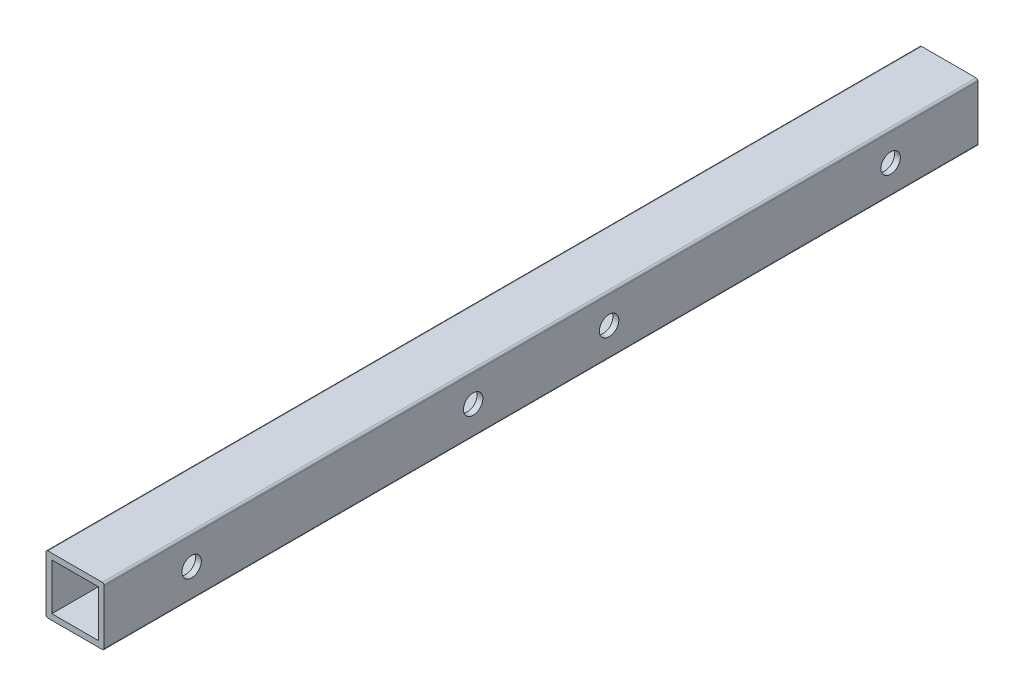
ISO-10303-21;
HEADER;
FILE_DESCRIPTION(('STEP AP214'),'2;1');
FILE_NAME('part.step','',(''),(''),'','','');
FILE_SCHEMA(('AUTOMOTIVE_DESIGN { 1 0 10303 214 1 1 1 1 }'));
ENDSEC;
DATA;
#1=APPLICATION_CONTEXT('core data for automotive mechanical design processes');
#2=APPLICATION_PROTOCOL_DEFINITION('international standard','automotive_design',2000,#1);
#3=PRODUCT_CONTEXT('',#1,'mechanical');
#4=PRODUCT('Part','Part','',(#3));
#5=PRODUCT_RELATED_PRODUCT_CATEGORY('part','',(#4));
#6=PRODUCT_DEFINITION_FORMATION('','',#4);
#7=PRODUCT_DEFINITION_CONTEXT('part definition',#1,'design');
#8=PRODUCT_DEFINITION('design','',#6,#7);
#9=PRODUCT_DEFINITION_SHAPE('','',#8);
#10=(LENGTH_UNIT() NAMED_UNIT(*) SI_UNIT(.MILLI.,.METRE.));
#11=(NAMED_UNIT(*) PLANE_ANGLE_UNIT() SI_UNIT($,.RADIAN.));
#12=(NAMED_UNIT(*) SI_UNIT($,.STERADIAN.) SOLID_ANGLE_UNIT());
#13=UNCERTAINTY_MEASURE_WITH_UNIT(LENGTH_MEASURE(1.E-05),#10,'distance_accuracy_value','');
#14=(GEOMETRIC_REPRESENTATION_CONTEXT(3) GLOBAL_UNCERTAINTY_ASSIGNED_CONTEXT((#13)) GLOBAL_UNIT_ASSIGNED_CONTEXT((#10,
#11,#12)) REPRESENTATION_CONTEXT('',''));
#15=CARTESIAN_POINT('',(0.,0.,0.));
#16=DIRECTION('',(0.,0.,1.));
#17=DIRECTION('',(1.,0.,0.));
#18=AXIS2_PLACEMENT_3D('',#15,#16,#17);
#19=CARTESIAN_POINT('',(-14.,-14.,0.));
#20=DIRECTION('',(0.,0.,-1.));
#21=DIRECTION('',(-1.,0.,0.));
#22=AXIS2_PLACEMENT_3D('',#19,#20,#21);
#23=PLANE('',#22);
#24=CARTESIAN_POINT('',(-14.,-14.,0.));
#25=DIRECTION('',(0.,0.,-1.));
#26=DIRECTION('',(-1.,0.,0.));
#27=AXIS2_PLACEMENT_3D('',#24,#25,#26);
#28=CIRCLE('',#27,0.999999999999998);
#29=CARTESIAN_POINT('',(-14.,-15.,0.));
#30=VERTEX_POINT('',#29);
#31=CARTESIAN_POINT('',(-15.,-14.,0.));
#32=VERTEX_POINT('',#31);
#33=EDGE_CURVE('E127',#30,#32,#28,.T.);
#34=ORIENTED_EDGE('',*,*,#33,.T.);
#35=DIRECTION('',(0.,-1.,0.));
#36=VECTOR('',#35,1.);
#37=CARTESIAN_POINT('',(-15.,14.,0.));
#38=LINE('',#37,#36);
#39=CARTESIAN_POINT('',(-15.,14.,0.));
#40=VERTEX_POINT('',#39);
#41=EDGE_CURVE('E163',#40,#32,#38,.T.);
#42=ORIENTED_EDGE('',*,*,#41,.F.);
#43=CARTESIAN_POINT('',(-14.,14.,0.));
#44=DIRECTION('',(0.,0.,-1.));
#45=DIRECTION('',(-1.,0.,0.));
#46=AXIS2_PLACEMENT_3D('',#43,#44,#45);
#47=CIRCLE('',#46,0.999999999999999);
#48=CARTESIAN_POINT('',(-14.,15.,0.));
#49=VERTEX_POINT('',#48);
#50=EDGE_CURVE('E166',#40,#49,#47,.T.);
#51=ORIENTED_EDGE('',*,*,#50,.T.);
#52=DIRECTION('',(1.,0.,0.));
#53=VECTOR('',#52,1.);
#54=CARTESIAN_POINT('',(-14.,15.,0.));
#55=LINE('',#54,#53);
#56=CARTESIAN_POINT('',(14.,15.,0.));
#57=VERTEX_POINT('',#56);
#58=EDGE_CURVE('E169',#49,#57,#55,.T.);
#59=ORIENTED_EDGE('',*,*,#58,.T.);
#60=CARTESIAN_POINT('',(14.,14.,0.));
#61=DIRECTION('',(0.,0.,1.));
#62=DIRECTION('',(1.,0.,0.));
#63=AXIS2_PLACEMENT_3D('',#60,#61,#62);
#64=CIRCLE('',#63,0.999999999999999);
#65=CARTESIAN_POINT('',(15.,14.,0.));
#66=VERTEX_POINT('',#65);
#67=EDGE_CURVE('E172',#66,#57,#64,.T.);
#68=ORIENTED_EDGE('',*,*,#67,.F.);
#69=DIRECTION('',(0.,1.,0.));
#70=VECTOR('',#69,1.);
#71=CARTESIAN_POINT('',(15.,-14.,0.));
#72=LINE('',#71,#70);
#73=CARTESIAN_POINT('',(15.,-14.,0.));
#74=VERTEX_POINT('',#73);
#75=EDGE_CURVE('E175',#74,#66,#72,.T.);
#76=ORIENTED_EDGE('',*,*,#75,.F.);
#77=CARTESIAN_POINT('',(14.,-14.,0.));
#78=DIRECTION('',(0.,0.,-1.));
#79=DIRECTION('',(-1.,0.,0.));
#80=AXIS2_PLACEMENT_3D('',#77,#78,#79);
#81=CIRCLE('',#80,1.);
#82=CARTESIAN_POINT('',(14.,-15.,0.));
#83=VERTEX_POINT('',#82);
#84=EDGE_CURVE('E177',#74,#83,#81,.T.);
#85=ORIENTED_EDGE('',*,*,#84,.T.);
#86=DIRECTION('',(-1.,0.,0.));
#87=VECTOR('',#86,1.);
#88=CARTESIAN_POINT('',(14.,-15.,0.));
#89=LINE('',#88,#87);
#90=EDGE_CURVE('E180',#83,#30,#89,.T.);
#91=ORIENTED_EDGE('',*,*,#90,.T.);
#92=EDGE_LOOP('',(#34,#42,#51,#59,#68,#76,#85,#91));
#93=FACE_BOUND('',#92,.T.);
#94=DIRECTION('',(1.,0.,0.));
#95=VECTOR('',#94,1.);
#96=CARTESIAN_POINT('',(-14.,12.,0.));
#97=LINE('',#96,#95);
#98=CARTESIAN_POINT('',(-12.,12.,0.));
#99=VERTEX_POINT('',#98);
#100=CARTESIAN_POINT('',(12.,12.,0.));
#101=VERTEX_POINT('',#100);
#102=EDGE_CURVE('E139',#99,#101,#97,.T.);
#103=ORIENTED_EDGE('',*,*,#102,.F.);
#104=DIRECTION('',(0.,-1.,0.));
#105=VECTOR('',#104,1.);
#106=CARTESIAN_POINT('',(-12.,-14.,0.));
#107=LINE('',#106,#105);
#108=CARTESIAN_POINT('',(-12.,-12.,0.));
#109=VERTEX_POINT('',#108);
#110=EDGE_CURVE('E55',#99,#109,#107,.T.);
#111=ORIENTED_EDGE('',*,*,#110,.T.);
#112=DIRECTION('',(-1.,0.,0.));
#113=VECTOR('',#112,1.);
#114=CARTESIAN_POINT('',(-14.,-12.,0.));
#115=LINE('',#114,#113);
#116=CARTESIAN_POINT('',(12.,-12.,0.));
#117=VERTEX_POINT('',#116);
#118=EDGE_CURVE('E131',#117,#109,#115,.T.);
#119=ORIENTED_EDGE('',*,*,#118,.F.);
#120=DIRECTION('',(0.,1.,0.));
#121=VECTOR('',#120,1.);
#122=CARTESIAN_POINT('',(12.,-14.,0.));
#123=LINE('',#122,#121);
#124=EDGE_CURVE('E136',#117,#101,#123,.T.);
#125=ORIENTED_EDGE('',*,*,#124,.T.);
#126=EDGE_LOOP('',(#103,#111,#119,#125));
#127=FACE_BOUND('',#126,.T.);
#128=ADVANCED_FACE('F30',(#93,#127),#23,.T.);
#129=CARTESIAN_POINT('',(-14.,-14.,450.));
#130=DIRECTION('',(0.,0.,-1.));
#131=DIRECTION('',(-1.,0.,0.));
#132=AXIS2_PLACEMENT_3D('',#129,#130,#131);
#133=CYLINDRICAL_SURFACE('',#132,0.999999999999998);
#134=ORIENTED_EDGE('',*,*,#33,.F.);
#135=DIRECTION('',(0.,0.,-1.));
#136=VECTOR('',#135,1.);
#137=CARTESIAN_POINT('',(-14.,-15.,450.));
#138=LINE('',#137,#136);
#139=CARTESIAN_POINT('',(-14.,-15.,450.));
#140=VERTEX_POINT('',#139);
#141=EDGE_CURVE('E11',#140,#30,#138,.T.);
#142=ORIENTED_EDGE('',*,*,#141,.F.);
#143=CARTESIAN_POINT('',(-14.,-14.,450.));
#144=DIRECTION('',(0.,0.,-1.));
#145=DIRECTION('',(-1.,0.,0.));
#146=AXIS2_PLACEMENT_3D('',#143,#144,#145);
#147=CIRCLE('',#146,0.999999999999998);
#148=CARTESIAN_POINT('',(-15.,-14.,450.));
#149=VERTEX_POINT('',#148);
#150=EDGE_CURVE('E183',#140,#149,#147,.T.);
#151=ORIENTED_EDGE('',*,*,#150,.T.);
#152=DIRECTION('',(0.,0.,-1.));
#153=VECTOR('',#152,1.);
#154=CARTESIAN_POINT('',(-15.,-14.,450.));
#155=LINE('',#154,#153);
#156=EDGE_CURVE('E203',#149,#32,#155,.T.);
#157=ORIENTED_EDGE('',*,*,#156,.T.);
#158=EDGE_LOOP('',(#134,#142,#151,#157));
#159=FACE_BOUND('',#158,.T.);
#160=ADVANCED_FACE('F32',(#159),#133,.T.);
#161=CARTESIAN_POINT('',(14.,-15.,450.));
#162=DIRECTION('',(0.,-1.,0.));
#163=DIRECTION('',(1.,0.,0.));
#164=AXIS2_PLACEMENT_3D('',#161,#162,#163);
#165=PLANE('',#164);
#166=ORIENTED_EDGE('',*,*,#90,.F.);
#167=DIRECTION('',(0.,0.,-1.));
#168=VECTOR('',#167,1.);
#169=CARTESIAN_POINT('',(14.,-15.,450.));
#170=LINE('',#169,#168);
#171=CARTESIAN_POINT('',(14.,-15.,450.));
#172=VERTEX_POINT('',#171);
#173=EDGE_CURVE('E39',#172,#83,#170,.T.);
#174=ORIENTED_EDGE('',*,*,#173,.F.);
#175=DIRECTION('',(-1.,0.,0.));
#176=VECTOR('',#175,1.);
#177=CARTESIAN_POINT('',(14.,-15.,450.));
#178=LINE('',#177,#176);
#179=EDGE_CURVE('E201',#172,#140,#178,.T.);
#180=ORIENTED_EDGE('',*,*,#179,.T.);
#181=ORIENTED_EDGE('',*,*,#141,.T.);
#182=EDGE_LOOP('',(#166,#174,#180,#181));
#183=FACE_BOUND('',#182,.T.);
#184=ADVANCED_FACE('F282',(#183),#165,.T.);
#185=CARTESIAN_POINT('',(14.,-14.,450.));
#186=DIRECTION('',(0.,0.,-1.));
#187=DIRECTION('',(-1.,0.,0.));
#188=AXIS2_PLACEMENT_3D('',#185,#186,#187);
#189=CYLINDRICAL_SURFACE('',#188,1.);
#190=ORIENTED_EDGE('',*,*,#84,.F.);
#191=DIRECTION('',(0.,0.,-1.));
#192=VECTOR('',#191,1.);
#193=CARTESIAN_POINT('',(15.,-14.,450.));
#194=LINE('',#193,#192);
#195=CARTESIAN_POINT('',(15.,-14.,450.));
#196=VERTEX_POINT('',#195);
#197=EDGE_CURVE('E206',#196,#74,#194,.T.);
#198=ORIENTED_EDGE('',*,*,#197,.F.);
#199=CARTESIAN_POINT('',(14.,-14.,450.));
#200=DIRECTION('',(0.,0.,-1.));
#201=DIRECTION('',(-1.,0.,0.));
#202=AXIS2_PLACEMENT_3D('',#199,#200,#201);
#203=CIRCLE('',#202,1.);
#204=EDGE_CURVE('E198',#196,#172,#203,.T.);
#205=ORIENTED_EDGE('',*,*,#204,.T.);
#206=ORIENTED_EDGE('',*,*,#173,.T.);
#207=EDGE_LOOP('',(#190,#198,#205,#206));
#208=FACE_BOUND('',#207,.T.);
#209=ADVANCED_FACE('F287',(#208),#189,.T.);
#210=CARTESIAN_POINT('',(15.,-14.,450.));
#211=DIRECTION('',(-1.,0.,0.));
#212=DIRECTION('',(0.,-1.,0.));
#213=AXIS2_PLACEMENT_3D('',#210,#211,#212);
#214=PLANE('',#213);
#215=CARTESIAN_POINT('',(15.,0.,45.));
#216=DIRECTION('',(-1.,0.,0.));
#217=DIRECTION('',(0.,-1.,0.));
#218=AXIS2_PLACEMENT_3D('',#215,#216,#217);
#219=CIRCLE('',#218,5.);
#220=CARTESIAN_POINT('',(15.,-5.,45.));
#221=VERTEX_POINT('',#220);
#222=EDGE_CURVE('E236',#221,#221,#219,.T.);
#223=ORIENTED_EDGE('',*,*,#222,.T.);
#224=EDGE_LOOP('',(#223));
#225=FACE_BOUND('',#224,.T.);
#226=CARTESIAN_POINT('',(15.,0.,260.));
#227=DIRECTION('',(-1.,0.,0.));
#228=DIRECTION('',(0.,-1.,0.));
#229=AXIS2_PLACEMENT_3D('',#226,#227,#228);
#230=CIRCLE('',#229,4.99999999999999);
#231=CARTESIAN_POINT('',(15.,-4.99999999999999,260.));
#232=VERTEX_POINT('',#231);
#233=EDGE_CURVE('E233',#232,#232,#230,.T.);
#234=ORIENTED_EDGE('',*,*,#233,.T.);
#235=EDGE_LOOP('',(#234));
#236=FACE_BOUND('',#235,.T.);
#237=CARTESIAN_POINT('',(15.,0.,190.));
#238=DIRECTION('',(-1.,0.,0.));
#239=DIRECTION('',(0.,-1.,0.));
#240=AXIS2_PLACEMENT_3D('',#237,#238,#239);
#241=CIRCLE('',#240,4.99999999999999);
#242=CARTESIAN_POINT('',(15.,-4.99999999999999,190.));
#243=VERTEX_POINT('',#242);
#244=EDGE_CURVE('E251',#243,#243,#241,.T.);
#245=ORIENTED_EDGE('',*,*,#244,.T.);
#246=EDGE_LOOP('',(#245));
#247=FACE_BOUND('',#246,.T.);
#248=CARTESIAN_POINT('',(15.,0.,405.));
#249=DIRECTION('',(-1.,0.,0.));
#250=DIRECTION('',(0.,-1.,0.));
#251=AXIS2_PLACEMENT_3D('',#248,#249,#250);
#252=CIRCLE('',#251,4.99999999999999);
#253=CARTESIAN_POINT('',(15.,-4.99999999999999,405.));
#254=VERTEX_POINT('',#253);
#255=EDGE_CURVE('E140',#254,#254,#252,.T.);
#256=ORIENTED_EDGE('',*,*,#255,.T.);
#257=EDGE_LOOP('',(#256));
#258=FACE_BOUND('',#257,.T.);
#259=ORIENTED_EDGE('',*,*,#75,.T.);
#260=DIRECTION('',(0.,0.,-1.));
#261=VECTOR('',#260,1.);
#262=CARTESIAN_POINT('',(15.,14.,450.));
#263=LINE('',#262,#261);
#264=CARTESIAN_POINT('',(15.,14.,450.));
#265=VERTEX_POINT('',#264);
#266=EDGE_CURVE('E208',#265,#66,#263,.T.);
#267=ORIENTED_EDGE('',*,*,#266,.F.);
#268=DIRECTION('',(0.,1.,0.));
#269=VECTOR('',#268,1.);
#270=CARTESIAN_POINT('',(15.,-14.,450.));
#271=LINE('',#270,#269);
#272=EDGE_CURVE('E196',#196,#265,#271,.T.);
#273=ORIENTED_EDGE('',*,*,#272,.F.);
#274=ORIENTED_EDGE('',*,*,#197,.T.);
#275=EDGE_LOOP('',(#259,#267,#273,#274));
#276=FACE_BOUND('',#275,.T.);
#277=ADVANCED_FACE('F291',(#225,#236,#247,#258,#276),#214,.F.);
#278=CARTESIAN_POINT('',(14.,14.,450.));
#279=DIRECTION('',(0.,0.,-1.));
#280=DIRECTION('',(-1.,0.,0.));
#281=AXIS2_PLACEMENT_3D('',#278,#279,#280);
#282=CYLINDRICAL_SURFACE('',#281,0.999999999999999);
#283=ORIENTED_EDGE('',*,*,#67,.T.);
#284=DIRECTION('',(0.,0.,-1.));
#285=VECTOR('',#284,1.);
#286=CARTESIAN_POINT('',(14.,15.,450.));
#287=LINE('',#286,#285);
#288=CARTESIAN_POINT('',(14.,15.,450.));
#289=VERTEX_POINT('',#288);
#290=EDGE_CURVE('E211',#289,#57,#287,.T.);
#291=ORIENTED_EDGE('',*,*,#290,.F.);
#292=CARTESIAN_POINT('',(14.,14.,450.));
#293=DIRECTION('',(0.,0.,1.));
#294=DIRECTION('',(1.,0.,0.));
#295=AXIS2_PLACEMENT_3D('',#292,#293,#294);
#296=CIRCLE('',#295,0.999999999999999);
#297=EDGE_CURVE('E194',#265,#289,#296,.T.);
#298=ORIENTED_EDGE('',*,*,#297,.F.);
#299=ORIENTED_EDGE('',*,*,#266,.T.);
#300=EDGE_LOOP('',(#283,#291,#298,#299));
#301=FACE_BOUND('',#300,.T.);
#302=ADVANCED_FACE('F295',(#301),#282,.T.);
#303=CARTESIAN_POINT('',(-14.,15.,450.));
#304=DIRECTION('',(0.,1.,0.));
#305=DIRECTION('',(0.,0.,1.));
#306=AXIS2_PLACEMENT_3D('',#303,#304,#305);
#307=PLANE('',#306);
#308=ORIENTED_EDGE('',*,*,#58,.F.);
#309=DIRECTION('',(0.,0.,-1.));
#310=VECTOR('',#309,1.);
#311=CARTESIAN_POINT('',(-14.,15.,450.));
#312=LINE('',#311,#310);
#313=CARTESIAN_POINT('',(-14.,15.,450.));
#314=VERTEX_POINT('',#313);
#315=EDGE_CURVE('E213',#314,#49,#312,.T.);
#316=ORIENTED_EDGE('',*,*,#315,.F.);
#317=DIRECTION('',(1.,0.,0.));
#318=VECTOR('',#317,1.);
#319=CARTESIAN_POINT('',(-14.,15.,450.));
#320=LINE('',#319,#318);
#321=EDGE_CURVE('E191',#314,#289,#320,.T.);
#322=ORIENTED_EDGE('',*,*,#321,.T.);
#323=ORIENTED_EDGE('',*,*,#290,.T.);
#324=EDGE_LOOP('',(#308,#316,#322,#323));
#325=FACE_BOUND('',#324,.T.);
#326=ADVANCED_FACE('F299',(#325),#307,.T.);
#327=CARTESIAN_POINT('',(-14.,14.,450.));
#328=DIRECTION('',(0.,0.,-1.));
#329=DIRECTION('',(-1.,0.,0.));
#330=AXIS2_PLACEMENT_3D('',#327,#328,#329);
#331=CYLINDRICAL_SURFACE('',#330,0.999999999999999);
#332=ORIENTED_EDGE('',*,*,#50,.F.);
#333=DIRECTION('',(0.,0.,-1.));
#334=VECTOR('',#333,1.);
#335=CARTESIAN_POINT('',(-15.,14.,450.));
#336=LINE('',#335,#334);
#337=CARTESIAN_POINT('',(-15.,14.,450.));
#338=VERTEX_POINT('',#337);
#339=EDGE_CURVE('E215',#338,#40,#336,.T.);
#340=ORIENTED_EDGE('',*,*,#339,.F.);
#341=CARTESIAN_POINT('',(-14.,14.,450.));
#342=DIRECTION('',(0.,0.,-1.));
#343=DIRECTION('',(-1.,0.,0.));
#344=AXIS2_PLACEMENT_3D('',#341,#342,#343);
#345=CIRCLE('',#344,0.999999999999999);
#346=EDGE_CURVE('E188',#338,#314,#345,.T.);
#347=ORIENTED_EDGE('',*,*,#346,.T.);
#348=ORIENTED_EDGE('',*,*,#315,.T.);
#349=EDGE_LOOP('',(#332,#340,#347,#348));
#350=FACE_BOUND('',#349,.T.);
#351=ADVANCED_FACE('F303',(#350),#331,.T.);
#352=CARTESIAN_POINT('',(-15.,14.,450.));
#353=DIRECTION('',(1.,0.,0.));
#354=DIRECTION('',(0.,1.,0.));
#355=AXIS2_PLACEMENT_3D('',#352,#353,#354);
#356=PLANE('',#355);
#357=CARTESIAN_POINT('',(-15.,0.,45.));
#358=DIRECTION('',(-1.,0.,0.));
#359=DIRECTION('',(0.,-1.,0.));
#360=AXIS2_PLACEMENT_3D('',#357,#358,#359);
#361=CIRCLE('',#360,5.);
#362=CARTESIAN_POINT('',(-15.,-4.99999999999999,45.));
#363=VERTEX_POINT('',#362);
#364=EDGE_CURVE('E314',#363,#363,#361,.T.);
#365=ORIENTED_EDGE('',*,*,#364,.F.);
#366=EDGE_LOOP('',(#365));
#367=FACE_BOUND('',#366,.T.);
#368=CARTESIAN_POINT('',(-15.,0.,260.));
#369=DIRECTION('',(-1.,0.,0.));
#370=DIRECTION('',(0.,-1.,0.));
#371=AXIS2_PLACEMENT_3D('',#368,#369,#370);
#372=CIRCLE('',#371,4.99999999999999);
#373=CARTESIAN_POINT('',(-15.,-4.99999999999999,260.));
#374=VERTEX_POINT('',#373);
#375=EDGE_CURVE('E229',#374,#374,#372,.T.);
#376=ORIENTED_EDGE('',*,*,#375,.F.);
#377=EDGE_LOOP('',(#376));
#378=FACE_BOUND('',#377,.T.);
#379=CARTESIAN_POINT('',(-15.,0.,190.));
#380=DIRECTION('',(-1.,0.,0.));
#381=DIRECTION('',(0.,-1.,0.));
#382=AXIS2_PLACEMENT_3D('',#379,#380,#381);
#383=CIRCLE('',#382,4.99999999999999);
#384=CARTESIAN_POINT('',(-15.,-4.99999999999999,190.));
#385=VERTEX_POINT('',#384);
#386=EDGE_CURVE('E225',#385,#385,#383,.T.);
#387=ORIENTED_EDGE('',*,*,#386,.F.);
#388=EDGE_LOOP('',(#387));
#389=FACE_BOUND('',#388,.T.);
#390=CARTESIAN_POINT('',(-15.,0.,405.));
#391=DIRECTION('',(-1.,0.,0.));
#392=DIRECTION('',(0.,-1.,0.));
#393=AXIS2_PLACEMENT_3D('',#390,#391,#392);
#394=CIRCLE('',#393,4.99999999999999);
#395=CARTESIAN_POINT('',(-15.,-4.99999999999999,405.));
#396=VERTEX_POINT('',#395);
#397=EDGE_CURVE('E221',#396,#396,#394,.T.);
#398=ORIENTED_EDGE('',*,*,#397,.F.);
#399=EDGE_LOOP('',(#398));
#400=FACE_BOUND('',#399,.T.);
#401=ORIENTED_EDGE('',*,*,#41,.T.);
#402=ORIENTED_EDGE('',*,*,#156,.F.);
#403=DIRECTION('',(0.,-1.,0.));
#404=VECTOR('',#403,1.);
#405=CARTESIAN_POINT('',(-15.,14.,450.));
#406=LINE('',#405,#404);
#407=EDGE_CURVE('E186',#338,#149,#406,.T.);
#408=ORIENTED_EDGE('',*,*,#407,.F.);
#409=ORIENTED_EDGE('',*,*,#339,.T.);
#410=EDGE_LOOP('',(#401,#402,#408,#409));
#411=FACE_BOUND('',#410,.T.);
#412=ADVANCED_FACE('F271',(#367,#378,#389,#400,#411),#356,.F.);
#413=CARTESIAN_POINT('',(-14.,-14.,450.));
#414=DIRECTION('',(0.,0.,-1.));
#415=DIRECTION('',(-1.,0.,0.));
#416=AXIS2_PLACEMENT_3D('',#413,#414,#415);
#417=PLANE('',#416);
#418=DIRECTION('',(0.,1.,0.));
#419=VECTOR('',#418,1.);
#420=CARTESIAN_POINT('',(12.,-14.,450.));
#421=LINE('',#420,#419);
#422=CARTESIAN_POINT('',(12.,-12.,450.));
#423=VERTEX_POINT('',#422);
#424=CARTESIAN_POINT('',(12.,12.,450.));
#425=VERTEX_POINT('',#424);
#426=EDGE_CURVE('E152',#423,#425,#421,.T.);
#427=ORIENTED_EDGE('',*,*,#426,.F.);
#428=DIRECTION('',(-1.,0.,0.));
#429=VECTOR('',#428,1.);
#430=CARTESIAN_POINT('',(-14.,-12.,450.));
#431=LINE('',#430,#429);
#432=CARTESIAN_POINT('',(-12.,-12.,450.));
#433=VERTEX_POINT('',#432);
#434=EDGE_CURVE('E150',#423,#433,#431,.T.);
#435=ORIENTED_EDGE('',*,*,#434,.T.);
#436=DIRECTION('',(0.,-1.,0.));
#437=VECTOR('',#436,1.);
#438=CARTESIAN_POINT('',(-12.,-14.,450.));
#439=LINE('',#438,#437);
#440=CARTESIAN_POINT('',(-12.,12.,450.));
#441=VERTEX_POINT('',#440);
#442=EDGE_CURVE('E123',#441,#433,#439,.T.);
#443=ORIENTED_EDGE('',*,*,#442,.F.);
#444=DIRECTION('',(1.,0.,0.));
#445=VECTOR('',#444,1.);
#446=CARTESIAN_POINT('',(-14.,12.,450.));
#447=LINE('',#446,#445);
#448=EDGE_CURVE('E154',#441,#425,#447,.T.);
#449=ORIENTED_EDGE('',*,*,#448,.T.);
#450=EDGE_LOOP('',(#427,#435,#443,#449));
#451=FACE_BOUND('',#450,.T.);
#452=ORIENTED_EDGE('',*,*,#150,.F.);
#453=ORIENTED_EDGE('',*,*,#179,.F.);
#454=ORIENTED_EDGE('',*,*,#204,.F.);
#455=ORIENTED_EDGE('',*,*,#272,.T.);
#456=ORIENTED_EDGE('',*,*,#297,.T.);
#457=ORIENTED_EDGE('',*,*,#321,.F.);
#458=ORIENTED_EDGE('',*,*,#346,.F.);
#459=ORIENTED_EDGE('',*,*,#407,.T.);
#460=EDGE_LOOP('',(#452,#453,#454,#455,#456,#457,#458,#459));
#461=FACE_BOUND('',#460,.T.);
#462=ADVANCED_FACE('F262',(#451,#461),#417,.F.);
#463=CARTESIAN_POINT('',(-12.,-14.,450.));
#464=DIRECTION('',(1.,0.,0.));
#465=DIRECTION('',(0.,1.,0.));
#466=AXIS2_PLACEMENT_3D('',#463,#464,#465);
#467=PLANE('',#466);
#468=CARTESIAN_POINT('',(-12.,0.,45.));
#469=DIRECTION('',(1.,0.,0.));
#470=DIRECTION('',(0.,1.,0.));
#471=AXIS2_PLACEMENT_3D('',#468,#469,#470);
#472=CIRCLE('',#471,5.);
#473=CARTESIAN_POINT('',(-12.,5.,45.));
#474=VERTEX_POINT('',#473);
#475=EDGE_CURVE('E241',#474,#474,#472,.T.);
#476=ORIENTED_EDGE('',*,*,#475,.F.);
#477=EDGE_LOOP('',(#476));
#478=FACE_BOUND('',#477,.T.);
#479=CARTESIAN_POINT('',(-12.,0.,260.));
#480=DIRECTION('',(1.,0.,0.));
#481=DIRECTION('',(0.,1.,0.));
#482=AXIS2_PLACEMENT_3D('',#479,#480,#481);
#483=CIRCLE('',#482,4.99999999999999);
#484=CARTESIAN_POINT('',(-12.,4.99999999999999,260.));
#485=VERTEX_POINT('',#484);
#486=EDGE_CURVE('E228',#485,#485,#483,.T.);
#487=ORIENTED_EDGE('',*,*,#486,.F.);
#488=EDGE_LOOP('',(#487));
#489=FACE_BOUND('',#488,.T.);
#490=CARTESIAN_POINT('',(-12.,0.,190.));
#491=DIRECTION('',(1.,0.,0.));
#492=DIRECTION('',(0.,1.,0.));
#493=AXIS2_PLACEMENT_3D('',#490,#491,#492);
#494=CIRCLE('',#493,4.99999999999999);
#495=CARTESIAN_POINT('',(-12.,4.99999999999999,190.));
#496=VERTEX_POINT('',#495);
#497=EDGE_CURVE('E224',#496,#496,#494,.T.);
#498=ORIENTED_EDGE('',*,*,#497,.F.);
#499=EDGE_LOOP('',(#498));
#500=FACE_BOUND('',#499,.T.);
#501=CARTESIAN_POINT('',(-12.,0.,405.));
#502=DIRECTION('',(1.,0.,0.));
#503=DIRECTION('',(0.,1.,0.));
#504=AXIS2_PLACEMENT_3D('',#501,#502,#503);
#505=CIRCLE('',#504,4.99999999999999);
#506=CARTESIAN_POINT('',(-12.,4.99999999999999,405.));
#507=VERTEX_POINT('',#506);
#508=EDGE_CURVE('E143',#507,#507,#505,.T.);
#509=ORIENTED_EDGE('',*,*,#508,.F.);
#510=EDGE_LOOP('',(#509));
#511=FACE_BOUND('',#510,.T.);
#512=ORIENTED_EDGE('',*,*,#110,.F.);
#513=DIRECTION('',(0.,0.,-1.));
#514=VECTOR('',#513,1.);
#515=CARTESIAN_POINT('',(-12.,12.,450.));
#516=LINE('',#515,#514);
#517=EDGE_CURVE('E157',#441,#99,#516,.T.);
#518=ORIENTED_EDGE('',*,*,#517,.F.);
#519=ORIENTED_EDGE('',*,*,#442,.T.);
#520=DIRECTION('',(0.,0.,-1.));
#521=VECTOR('',#520,1.);
#522=CARTESIAN_POINT('',(-12.,-12.,450.));
#523=LINE('',#522,#521);
#524=EDGE_CURVE('E119',#433,#109,#523,.T.);
#525=ORIENTED_EDGE('',*,*,#524,.T.);
#526=EDGE_LOOP('',(#512,#518,#519,#525));
#527=FACE_BOUND('',#526,.T.);
#528=ADVANCED_FACE('F121',(#478,#489,#500,#511,#527),#467,.T.);
#529=CARTESIAN_POINT('',(-14.,-12.,450.));
#530=DIRECTION('',(0.,-1.,0.));
#531=DIRECTION('',(1.,0.,0.));
#532=AXIS2_PLACEMENT_3D('',#529,#530,#531);
#533=PLANE('',#532);
#534=ORIENTED_EDGE('',*,*,#118,.T.);
#535=ORIENTED_EDGE('',*,*,#524,.F.);
#536=ORIENTED_EDGE('',*,*,#434,.F.);
#537=DIRECTION('',(0.,0.,-1.));
#538=VECTOR('',#537,1.);
#539=CARTESIAN_POINT('',(12.,-12.,450.));
#540=LINE('',#539,#538);
#541=EDGE_CURVE('E128',#423,#117,#540,.T.);
#542=ORIENTED_EDGE('',*,*,#541,.T.);
#543=EDGE_LOOP('',(#534,#535,#536,#542));
#544=FACE_BOUND('',#543,.T.);
#545=ADVANCED_FACE('F132',(#544),#533,.F.);
#546=CARTESIAN_POINT('',(12.,-14.,450.));
#547=DIRECTION('',(-1.,0.,0.));
#548=DIRECTION('',(0.,-1.,0.));
#549=AXIS2_PLACEMENT_3D('',#546,#547,#548);
#550=PLANE('',#549);
#551=CARTESIAN_POINT('',(12.,0.,45.));
#552=DIRECTION('',(-1.,0.,0.));
#553=DIRECTION('',(0.,-1.,0.));
#554=AXIS2_PLACEMENT_3D('',#551,#552,#553);
#555=CIRCLE('',#554,5.);
#556=CARTESIAN_POINT('',(12.,-5.,45.));
#557=VERTEX_POINT('',#556);
#558=EDGE_CURVE('E34',#557,#557,#555,.T.);
#559=ORIENTED_EDGE('',*,*,#558,.F.);
#560=EDGE_LOOP('',(#559));
#561=FACE_BOUND('',#560,.T.);
#562=CARTESIAN_POINT('',(12.,0.,260.));
#563=DIRECTION('',(-1.,0.,0.));
#564=DIRECTION('',(0.,-1.,0.));
#565=AXIS2_PLACEMENT_3D('',#562,#563,#564);
#566=CIRCLE('',#565,4.99999999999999);
#567=CARTESIAN_POINT('',(12.,-4.99999999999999,260.));
#568=VERTEX_POINT('',#567);
#569=EDGE_CURVE('E226',#568,#568,#566,.T.);
#570=ORIENTED_EDGE('',*,*,#569,.F.);
#571=EDGE_LOOP('',(#570));
#572=FACE_BOUND('',#571,.T.);
#573=CARTESIAN_POINT('',(12.,0.,190.));
#574=DIRECTION('',(-1.,0.,0.));
#575=DIRECTION('',(0.,-1.,0.));
#576=AXIS2_PLACEMENT_3D('',#573,#574,#575);
#577=CIRCLE('',#576,4.99999999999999);
#578=CARTESIAN_POINT('',(12.,-4.99999999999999,190.));
#579=VERTEX_POINT('',#578);
#580=EDGE_CURVE('E222',#579,#579,#577,.T.);
#581=ORIENTED_EDGE('',*,*,#580,.F.);
#582=EDGE_LOOP('',(#581));
#583=FACE_BOUND('',#582,.T.);
#584=CARTESIAN_POINT('',(12.,0.,405.));
#585=DIRECTION('',(-1.,0.,0.));
#586=DIRECTION('',(0.,-1.,0.));
#587=AXIS2_PLACEMENT_3D('',#584,#585,#586);
#588=CIRCLE('',#587,4.99999999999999);
#589=CARTESIAN_POINT('',(12.,-4.99999999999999,405.));
#590=VERTEX_POINT('',#589);
#591=EDGE_CURVE('E218',#590,#590,#588,.T.);
#592=ORIENTED_EDGE('',*,*,#591,.F.);
#593=EDGE_LOOP('',(#592));
#594=FACE_BOUND('',#593,.T.);
#595=ORIENTED_EDGE('',*,*,#124,.F.);
#596=ORIENTED_EDGE('',*,*,#541,.F.);
#597=ORIENTED_EDGE('',*,*,#426,.T.);
#598=DIRECTION('',(0.,0.,-1.));
#599=VECTOR('',#598,1.);
#600=CARTESIAN_POINT('',(12.,12.,450.));
#601=LINE('',#600,#599);
#602=EDGE_CURVE('E47',#425,#101,#601,.T.);
#603=ORIENTED_EDGE('',*,*,#602,.T.);
#604=EDGE_LOOP('',(#595,#596,#597,#603));
#605=FACE_BOUND('',#604,.T.);
#606=ADVANCED_FACE('F269',(#561,#572,#583,#594,#605),#550,.T.);
#607=CARTESIAN_POINT('',(-14.,12.,450.));
#608=DIRECTION('',(0.,1.,0.));
#609=DIRECTION('',(0.,0.,1.));
#610=AXIS2_PLACEMENT_3D('',#607,#608,#609);
#611=PLANE('',#610);
#612=ORIENTED_EDGE('',*,*,#102,.T.);
#613=ORIENTED_EDGE('',*,*,#602,.F.);
#614=ORIENTED_EDGE('',*,*,#448,.F.);
#615=ORIENTED_EDGE('',*,*,#517,.T.);
#616=EDGE_LOOP('',(#612,#613,#614,#615));
#617=FACE_BOUND('',#616,.T.);
#618=ADVANCED_FACE('F352',(#617),#611,.F.);
#619=CARTESIAN_POINT('',(25.,0.,405.));
#620=DIRECTION('',(-1.,0.,0.));
#621=DIRECTION('',(0.,-1.,0.));
#622=AXIS2_PLACEMENT_3D('',#619,#620,#621);
#623=CYLINDRICAL_SURFACE('',#622,4.99999999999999);
#624=ORIENTED_EDGE('',*,*,#591,.T.);
#625=EDGE_LOOP('',(#624));
#626=FACE_BOUND('',#625,.T.);
#627=ORIENTED_EDGE('',*,*,#255,.F.);
#628=EDGE_LOOP('',(#627));
#629=FACE_BOUND('',#628,.T.);
#630=ADVANCED_FACE('F343',(#626,#629),#623,.F.);
#631=ORIENTED_EDGE('',*,*,#508,.T.);
#632=EDGE_LOOP('',(#631));
#633=FACE_BOUND('',#632,.T.);
#634=ORIENTED_EDGE('',*,*,#397,.T.);
#635=EDGE_LOOP('',(#634));
#636=FACE_BOUND('',#635,.T.);
#637=ADVANCED_FACE('F258',(#633,#636),#623,.F.);
#638=CARTESIAN_POINT('',(25.,0.,190.));
#639=DIRECTION('',(-1.,0.,0.));
#640=DIRECTION('',(0.,-1.,0.));
#641=AXIS2_PLACEMENT_3D('',#638,#639,#640);
#642=CYLINDRICAL_SURFACE('',#641,4.99999999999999);
#643=ORIENTED_EDGE('',*,*,#580,.T.);
#644=EDGE_LOOP('',(#643));
#645=FACE_BOUND('',#644,.T.);
#646=ORIENTED_EDGE('',*,*,#244,.F.);
#647=EDGE_LOOP('',(#646));
#648=FACE_BOUND('',#647,.T.);
#649=ADVANCED_FACE('F342',(#645,#648),#642,.F.);
#650=ORIENTED_EDGE('',*,*,#497,.T.);
#651=EDGE_LOOP('',(#650));
#652=FACE_BOUND('',#651,.T.);
#653=ORIENTED_EDGE('',*,*,#386,.T.);
#654=EDGE_LOOP('',(#653));
#655=FACE_BOUND('',#654,.T.);
#656=ADVANCED_FACE('F349',(#652,#655),#642,.F.);
#657=CARTESIAN_POINT('',(25.,0.,260.));
#658=DIRECTION('',(-1.,0.,0.));
#659=DIRECTION('',(0.,-1.,0.));
#660=AXIS2_PLACEMENT_3D('',#657,#658,#659);
#661=CYLINDRICAL_SURFACE('',#660,4.99999999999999);
#662=ORIENTED_EDGE('',*,*,#569,.T.);
#663=EDGE_LOOP('',(#662));
#664=FACE_BOUND('',#663,.T.);
#665=ORIENTED_EDGE('',*,*,#233,.F.);
#666=EDGE_LOOP('',(#665));
#667=FACE_BOUND('',#666,.T.);
#668=ADVANCED_FACE('F390',(#664,#667),#661,.F.);
#669=ORIENTED_EDGE('',*,*,#486,.T.);
#670=EDGE_LOOP('',(#669));
#671=FACE_BOUND('',#670,.T.);
#672=ORIENTED_EDGE('',*,*,#375,.T.);
#673=EDGE_LOOP('',(#672));
#674=FACE_BOUND('',#673,.T.);
#675=ADVANCED_FACE('F389',(#671,#674),#661,.F.);
#676=CARTESIAN_POINT('',(25.,0.,45.));
#677=DIRECTION('',(-1.,0.,0.));
#678=DIRECTION('',(0.,-1.,0.));
#679=AXIS2_PLACEMENT_3D('',#676,#677,#678);
#680=CYLINDRICAL_SURFACE('',#679,5.);
#681=ORIENTED_EDGE('',*,*,#558,.T.);
#682=EDGE_LOOP('',(#681));
#683=FACE_BOUND('',#682,.T.);
#684=ORIENTED_EDGE('',*,*,#222,.F.);
#685=EDGE_LOOP('',(#684));
#686=FACE_BOUND('',#685,.T.);
#687=ADVANCED_FACE('F383',(#683,#686),#680,.F.);
#688=ORIENTED_EDGE('',*,*,#475,.T.);
#689=EDGE_LOOP('',(#688));
#690=FACE_BOUND('',#689,.T.);
#691=ORIENTED_EDGE('',*,*,#364,.T.);
#692=EDGE_LOOP('',(#691));
#693=FACE_BOUND('',#692,.T.);
#694=ADVANCED_FACE('F381',(#690,#693),#680,.F.);
#695=CLOSED_SHELL('',(#128,#160,#184,#209,#277,#302,#326,#351,#412,#462,#528,#545,#606,#618,
#630,#637,#649,#656,#668,#675,#687,#694));
#696=MANIFOLD_SOLID_BREP('B2',#695);
#697=ADVANCED_BREP_SHAPE_REPRESENTATION('',(#18,#696),#14);
#698=SHAPE_DEFINITION_REPRESENTATION(#9,#697);
ENDSEC;
END-ISO-10303-21;
